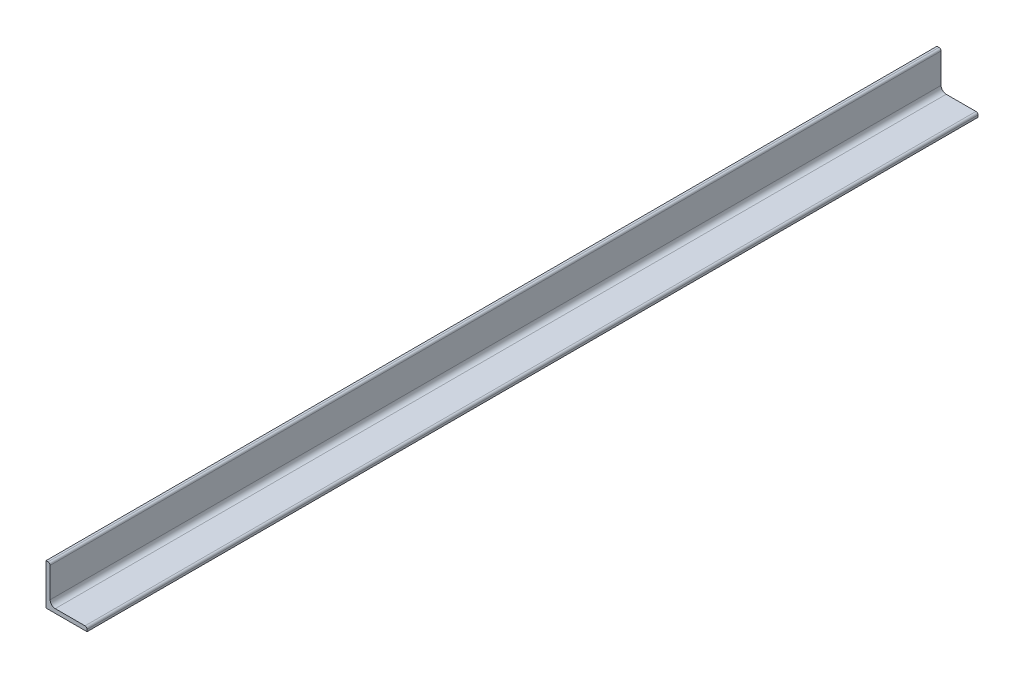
ISO-10303-21;
HEADER;
FILE_DESCRIPTION(('STEP AP214'),'2;1');
FILE_NAME('part.step','',(''),(''),'','','');
FILE_SCHEMA(('AUTOMOTIVE_DESIGN { 1 0 10303 214 1 1 1 1 }'));
ENDSEC;
DATA;
#1=APPLICATION_CONTEXT('core data for automotive mechanical design processes');
#2=APPLICATION_PROTOCOL_DEFINITION('international standard','automotive_design',2000,#1);
#3=PRODUCT_CONTEXT('',#1,'mechanical');
#4=PRODUCT('Part','Part','',(#3));
#5=PRODUCT_RELATED_PRODUCT_CATEGORY('part','',(#4));
#6=PRODUCT_DEFINITION_FORMATION('','',#4);
#7=PRODUCT_DEFINITION_CONTEXT('part definition',#1,'design');
#8=PRODUCT_DEFINITION('design','',#6,#7);
#9=PRODUCT_DEFINITION_SHAPE('','',#8);
#10=(LENGTH_UNIT() NAMED_UNIT(*) SI_UNIT(.MILLI.,.METRE.));
#11=(NAMED_UNIT(*) PLANE_ANGLE_UNIT() SI_UNIT($,.RADIAN.));
#12=(NAMED_UNIT(*) SI_UNIT($,.STERADIAN.) SOLID_ANGLE_UNIT());
#13=UNCERTAINTY_MEASURE_WITH_UNIT(LENGTH_MEASURE(1.E-05),#10,'distance_accuracy_value','');
#14=(GEOMETRIC_REPRESENTATION_CONTEXT(3) GLOBAL_UNCERTAINTY_ASSIGNED_CONTEXT((#13)) GLOBAL_UNIT_ASSIGNED_CONTEXT((#10,
#11,#12)) REPRESENTATION_CONTEXT('',''));
#15=CARTESIAN_POINT('',(0.,0.,0.));
#16=DIRECTION('',(0.,0.,1.));
#17=DIRECTION('',(1.,0.,0.));
#18=AXIS2_PLACEMENT_3D('',#15,#16,#17);
#19=CARTESIAN_POINT('',(1.99999999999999,40.,868.));
#20=DIRECTION('',(0.,-1.,0.));
#21=DIRECTION('',(0.,0.,-1.));
#22=AXIS2_PLACEMENT_3D('',#19,#20,#21);
#23=PLANE('',#22);
#24=DIRECTION('',(-1.,0.,0.));
#25=VECTOR('',#24,1.);
#26=CARTESIAN_POINT('',(1.99999999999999,40.,0.));
#27=LINE('',#26,#25);
#28=CARTESIAN_POINT('',(1.99999999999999,40.,0.));
#29=VERTEX_POINT('',#28);
#30=CARTESIAN_POINT('',(0.,40.,0.));
#31=VERTEX_POINT('',#30);
#32=EDGE_CURVE('E141',#29,#31,#27,.T.);
#33=ORIENTED_EDGE('',*,*,#32,.T.);
#34=DIRECTION('',(0.,0.,-1.));
#35=VECTOR('',#34,1.);
#36=CARTESIAN_POINT('',(0.,40.,868.));
#37=LINE('',#36,#35);
#38=CARTESIAN_POINT('',(0.,40.,868.));
#39=VERTEX_POINT('',#38);
#40=EDGE_CURVE('E11',#39,#31,#37,.T.);
#41=ORIENTED_EDGE('',*,*,#40,.F.);
#42=DIRECTION('',(-1.,0.,0.));
#43=VECTOR('',#42,1.);
#44=CARTESIAN_POINT('',(1.99999999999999,40.,868.));
#45=LINE('',#44,#43);
#46=CARTESIAN_POINT('',(1.99999999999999,40.,868.));
#47=VERTEX_POINT('',#46);
#48=EDGE_CURVE('E157',#47,#39,#45,.T.);
#49=ORIENTED_EDGE('',*,*,#48,.F.);
#50=DIRECTION('',(0.,0.,-1.));
#51=VECTOR('',#50,1.);
#52=CARTESIAN_POINT('',(1.99999999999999,40.,868.));
#53=LINE('',#52,#51);
#54=EDGE_CURVE('E137',#47,#29,#53,.T.);
#55=ORIENTED_EDGE('',*,*,#54,.T.);
#56=EDGE_LOOP('',(#33,#41,#49,#55));
#57=FACE_BOUND('',#56,.T.);
#58=ADVANCED_FACE('F39',(#57),#23,.F.);
#59=CARTESIAN_POINT('',(0.,40.,868.));
#60=DIRECTION('',(1.,0.,0.));
#61=DIRECTION('',(0.,1.,0.));
#62=AXIS2_PLACEMENT_3D('',#59,#60,#61);
#63=PLANE('',#62);
#64=DIRECTION('',(0.,-1.,0.));
#65=VECTOR('',#64,1.);
#66=CARTESIAN_POINT('',(0.,40.,0.));
#67=LINE('',#66,#65);
#68=CARTESIAN_POINT('',(0.,0.,0.));
#69=VERTEX_POINT('',#68);
#70=EDGE_CURVE('E144',#31,#69,#67,.T.);
#71=ORIENTED_EDGE('',*,*,#70,.T.);
#72=DIRECTION('',(0.,0.,-1.));
#73=VECTOR('',#72,1.);
#74=CARTESIAN_POINT('',(0.,0.,868.));
#75=LINE('',#74,#73);
#76=CARTESIAN_POINT('',(0.,0.,868.));
#77=VERTEX_POINT('',#76);
#78=EDGE_CURVE('E47',#77,#69,#75,.T.);
#79=ORIENTED_EDGE('',*,*,#78,.F.);
#80=DIRECTION('',(0.,-1.,0.));
#81=VECTOR('',#80,1.);
#82=CARTESIAN_POINT('',(0.,40.,868.));
#83=LINE('',#82,#81);
#84=EDGE_CURVE('E101',#39,#77,#83,.T.);
#85=ORIENTED_EDGE('',*,*,#84,.F.);
#86=ORIENTED_EDGE('',*,*,#40,.T.);
#87=EDGE_LOOP('',(#71,#79,#85,#86));
#88=FACE_BOUND('',#87,.T.);
#89=ADVANCED_FACE('F200',(#88),#63,.F.);
#90=CARTESIAN_POINT('',(0.,0.,868.));
#91=DIRECTION('',(0.,1.,0.));
#92=DIRECTION('',(0.,0.,1.));
#93=AXIS2_PLACEMENT_3D('',#90,#91,#92);
#94=PLANE('',#93);
#95=DIRECTION('',(1.,0.,0.));
#96=VECTOR('',#95,1.);
#97=CARTESIAN_POINT('',(0.,0.,0.));
#98=LINE('',#97,#96);
#99=CARTESIAN_POINT('',(40.,0.,0.));
#100=VERTEX_POINT('',#99);
#101=EDGE_CURVE('E146',#69,#100,#98,.T.);
#102=ORIENTED_EDGE('',*,*,#101,.T.);
#103=DIRECTION('',(0.,0.,-1.));
#104=VECTOR('',#103,1.);
#105=CARTESIAN_POINT('',(40.,0.,868.));
#106=LINE('',#105,#104);
#107=CARTESIAN_POINT('',(40.,0.,868.));
#108=VERTEX_POINT('',#107);
#109=EDGE_CURVE('E167',#108,#100,#106,.T.);
#110=ORIENTED_EDGE('',*,*,#109,.F.);
#111=DIRECTION('',(1.,0.,0.));
#112=VECTOR('',#111,1.);
#113=CARTESIAN_POINT('',(0.,0.,868.));
#114=LINE('',#113,#112);
#115=EDGE_CURVE('E175',#77,#108,#114,.T.);
#116=ORIENTED_EDGE('',*,*,#115,.F.);
#117=ORIENTED_EDGE('',*,*,#78,.T.);
#118=EDGE_LOOP('',(#102,#110,#116,#117));
#119=FACE_BOUND('',#118,.T.);
#120=ADVANCED_FACE('F173',(#119),#94,.F.);
#121=CARTESIAN_POINT('',(40.,0.,868.));
#122=DIRECTION('',(-1.,0.,0.));
#123=DIRECTION('',(0.,0.,1.));
#124=AXIS2_PLACEMENT_3D('',#121,#122,#123);
#125=PLANE('',#124);
#126=DIRECTION('',(0.,1.,0.));
#127=VECTOR('',#126,1.);
#128=CARTESIAN_POINT('',(40.,0.,0.));
#129=LINE('',#128,#127);
#130=CARTESIAN_POINT('',(40.,1.99999999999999,0.));
#131=VERTEX_POINT('',#130);
#132=EDGE_CURVE('E148',#100,#131,#129,.T.);
#133=ORIENTED_EDGE('',*,*,#132,.T.);
#134=DIRECTION('',(0.,0.,-1.));
#135=VECTOR('',#134,1.);
#136=CARTESIAN_POINT('',(40.,1.99999999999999,868.));
#137=LINE('',#136,#135);
#138=CARTESIAN_POINT('',(40.,1.99999999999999,868.));
#139=VERTEX_POINT('',#138);
#140=EDGE_CURVE('E164',#139,#131,#137,.T.);
#141=ORIENTED_EDGE('',*,*,#140,.F.);
#142=DIRECTION('',(0.,1.,0.));
#143=VECTOR('',#142,1.);
#144=CARTESIAN_POINT('',(40.,0.,868.));
#145=LINE('',#144,#143);
#146=EDGE_CURVE('E191',#108,#139,#145,.T.);
#147=ORIENTED_EDGE('',*,*,#146,.F.);
#148=ORIENTED_EDGE('',*,*,#109,.T.);
#149=EDGE_LOOP('',(#133,#141,#147,#148));
#150=FACE_BOUND('',#149,.T.);
#151=ADVANCED_FACE('F184',(#150),#125,.F.);
#152=CARTESIAN_POINT('',(38.,2.,868.));
#153=DIRECTION('',(0.,0.,-1.));
#154=DIRECTION('',(-1.,0.,0.));
#155=AXIS2_PLACEMENT_3D('',#152,#153,#154);
#156=CYLINDRICAL_SURFACE('',#155,2.);
#157=CARTESIAN_POINT('',(38.,2.,0.));
#158=DIRECTION('',(0.,0.,1.));
#159=DIRECTION('',(1.,0.,0.));
#160=AXIS2_PLACEMENT_3D('',#157,#158,#159);
#161=CIRCLE('',#160,2.);
#162=CARTESIAN_POINT('',(38.,4.,0.));
#163=VERTEX_POINT('',#162);
#164=EDGE_CURVE('E150',#131,#163,#161,.T.);
#165=ORIENTED_EDGE('',*,*,#164,.T.);
#166=DIRECTION('',(0.,0.,-1.));
#167=VECTOR('',#166,1.);
#168=CARTESIAN_POINT('',(38.,4.,868.));
#169=LINE('',#168,#167);
#170=CARTESIAN_POINT('',(38.,4.,868.));
#171=VERTEX_POINT('',#170);
#172=EDGE_CURVE('E161',#171,#163,#169,.T.);
#173=ORIENTED_EDGE('',*,*,#172,.F.);
#174=CARTESIAN_POINT('',(38.,2.,868.));
#175=DIRECTION('',(0.,0.,1.));
#176=DIRECTION('',(1.,0.,0.));
#177=AXIS2_PLACEMENT_3D('',#174,#175,#176);
#178=CIRCLE('',#177,2.);
#179=EDGE_CURVE('E190',#139,#171,#178,.T.);
#180=ORIENTED_EDGE('',*,*,#179,.F.);
#181=ORIENTED_EDGE('',*,*,#140,.T.);
#182=EDGE_LOOP('',(#165,#173,#180,#181));
#183=FACE_BOUND('',#182,.T.);
#184=ADVANCED_FACE('F188',(#183),#156,.T.);
#185=CARTESIAN_POINT('',(38.,4.,868.));
#186=DIRECTION('',(0.,-1.,0.));
#187=DIRECTION('',(1.,0.,0.));
#188=AXIS2_PLACEMENT_3D('',#185,#186,#187);
#189=PLANE('',#188);
#190=DIRECTION('',(-1.,0.,0.));
#191=VECTOR('',#190,1.);
#192=CARTESIAN_POINT('',(38.,4.,0.));
#193=LINE('',#192,#191);
#194=CARTESIAN_POINT('',(9.00000000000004,4.,0.));
#195=VERTEX_POINT('',#194);
#196=EDGE_CURVE('E152',#163,#195,#193,.T.);
#197=ORIENTED_EDGE('',*,*,#196,.T.);
#198=DIRECTION('',(0.,0.,-1.));
#199=VECTOR('',#198,1.);
#200=CARTESIAN_POINT('',(9.00000000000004,4.,868.));
#201=LINE('',#200,#199);
#202=CARTESIAN_POINT('',(9.00000000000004,4.,868.));
#203=VERTEX_POINT('',#202);
#204=EDGE_CURVE('E132',#203,#195,#201,.T.);
#205=ORIENTED_EDGE('',*,*,#204,.F.);
#206=DIRECTION('',(-1.,0.,0.));
#207=VECTOR('',#206,1.);
#208=CARTESIAN_POINT('',(38.,4.,868.));
#209=LINE('',#208,#207);
#210=EDGE_CURVE('E123',#171,#203,#209,.T.);
#211=ORIENTED_EDGE('',*,*,#210,.F.);
#212=ORIENTED_EDGE('',*,*,#172,.T.);
#213=EDGE_LOOP('',(#197,#205,#211,#212));
#214=FACE_BOUND('',#213,.T.);
#215=ADVANCED_FACE('F212',(#214),#189,.F.);
#216=CARTESIAN_POINT('',(9.,9.,868.));
#217=DIRECTION('',(0.,0.,-1.));
#218=DIRECTION('',(-1.,0.,0.));
#219=AXIS2_PLACEMENT_3D('',#216,#217,#218);
#220=CYLINDRICAL_SURFACE('',#219,5.);
#221=CARTESIAN_POINT('',(9.,9.,0.));
#222=DIRECTION('',(0.,0.,-1.));
#223=DIRECTION('',(-1.,0.,0.));
#224=AXIS2_PLACEMENT_3D('',#221,#222,#223);
#225=CIRCLE('',#224,5.);
#226=CARTESIAN_POINT('',(4.,9.00000000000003,0.));
#227=VERTEX_POINT('',#226);
#228=EDGE_CURVE('E131',#195,#227,#225,.T.);
#229=ORIENTED_EDGE('',*,*,#228,.T.);
#230=DIRECTION('',(0.,0.,-1.));
#231=VECTOR('',#230,1.);
#232=CARTESIAN_POINT('',(4.,9.00000000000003,868.));
#233=LINE('',#232,#231);
#234=CARTESIAN_POINT('',(4.,9.00000000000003,868.));
#235=VERTEX_POINT('',#234);
#236=EDGE_CURVE('E128',#235,#227,#233,.T.);
#237=ORIENTED_EDGE('',*,*,#236,.F.);
#238=CARTESIAN_POINT('',(9.,9.,868.));
#239=DIRECTION('',(0.,0.,-1.));
#240=DIRECTION('',(-1.,0.,0.));
#241=AXIS2_PLACEMENT_3D('',#238,#239,#240);
#242=CIRCLE('',#241,5.);
#243=EDGE_CURVE('E117',#203,#235,#242,.T.);
#244=ORIENTED_EDGE('',*,*,#243,.F.);
#245=ORIENTED_EDGE('',*,*,#204,.T.);
#246=EDGE_LOOP('',(#229,#237,#244,#245));
#247=FACE_BOUND('',#246,.T.);
#248=ADVANCED_FACE('F129',(#247),#220,.F.);
#249=CARTESIAN_POINT('',(4.,9.00000000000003,868.));
#250=DIRECTION('',(-1.,0.,0.));
#251=DIRECTION('',(0.,-1.,0.));
#252=AXIS2_PLACEMENT_3D('',#249,#250,#251);
#253=PLANE('',#252);
#254=DIRECTION('',(0.,1.,0.));
#255=VECTOR('',#254,1.);
#256=CARTESIAN_POINT('',(4.,9.00000000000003,0.));
#257=LINE('',#256,#255);
#258=CARTESIAN_POINT('',(4.,38.,0.));
#259=VERTEX_POINT('',#258);
#260=EDGE_CURVE('E87',#227,#259,#257,.T.);
#261=ORIENTED_EDGE('',*,*,#260,.T.);
#262=DIRECTION('',(0.,0.,-1.));
#263=VECTOR('',#262,1.);
#264=CARTESIAN_POINT('',(4.,38.,868.));
#265=LINE('',#264,#263);
#266=CARTESIAN_POINT('',(4.,38.,868.));
#267=VERTEX_POINT('',#266);
#268=EDGE_CURVE('E133',#267,#259,#265,.T.);
#269=ORIENTED_EDGE('',*,*,#268,.F.);
#270=DIRECTION('',(0.,1.,0.));
#271=VECTOR('',#270,1.);
#272=CARTESIAN_POINT('',(4.,9.00000000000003,868.));
#273=LINE('',#272,#271);
#274=EDGE_CURVE('E121',#235,#267,#273,.T.);
#275=ORIENTED_EDGE('',*,*,#274,.F.);
#276=ORIENTED_EDGE('',*,*,#236,.T.);
#277=EDGE_LOOP('',(#261,#269,#275,#276));
#278=FACE_BOUND('',#277,.T.);
#279=ADVANCED_FACE('F135',(#278),#253,.F.);
#280=CARTESIAN_POINT('',(2.,38.,868.));
#281=DIRECTION('',(0.,0.,-1.));
#282=DIRECTION('',(-1.,0.,0.));
#283=AXIS2_PLACEMENT_3D('',#280,#281,#282);
#284=CYLINDRICAL_SURFACE('',#283,2.);
#285=CARTESIAN_POINT('',(2.,38.,0.));
#286=DIRECTION('',(0.,0.,1.));
#287=DIRECTION('',(1.,0.,0.));
#288=AXIS2_PLACEMENT_3D('',#285,#286,#287);
#289=CIRCLE('',#288,2.);
#290=EDGE_CURVE('E93',#259,#29,#289,.T.);
#291=ORIENTED_EDGE('',*,*,#290,.T.);
#292=ORIENTED_EDGE('',*,*,#54,.F.);
#293=CARTESIAN_POINT('',(2.,38.,868.));
#294=DIRECTION('',(0.,0.,1.));
#295=DIRECTION('',(1.,0.,0.));
#296=AXIS2_PLACEMENT_3D('',#293,#294,#295);
#297=CIRCLE('',#296,2.);
#298=EDGE_CURVE('E55',#267,#47,#297,.T.);
#299=ORIENTED_EDGE('',*,*,#298,.F.);
#300=ORIENTED_EDGE('',*,*,#268,.T.);
#301=EDGE_LOOP('',(#291,#292,#299,#300));
#302=FACE_BOUND('',#301,.T.);
#303=ADVANCED_FACE('F220',(#302),#284,.T.);
#304=CARTESIAN_POINT('',(38.,2.,868.));
#305=DIRECTION('',(0.,0.,1.));
#306=DIRECTION('',(1.,0.,0.));
#307=AXIS2_PLACEMENT_3D('',#304,#305,#306);
#308=PLANE('',#307);
#309=ORIENTED_EDGE('',*,*,#48,.T.);
#310=ORIENTED_EDGE('',*,*,#84,.T.);
#311=ORIENTED_EDGE('',*,*,#115,.T.);
#312=ORIENTED_EDGE('',*,*,#146,.T.);
#313=ORIENTED_EDGE('',*,*,#179,.T.);
#314=ORIENTED_EDGE('',*,*,#210,.T.);
#315=ORIENTED_EDGE('',*,*,#243,.T.);
#316=ORIENTED_EDGE('',*,*,#274,.T.);
#317=ORIENTED_EDGE('',*,*,#298,.T.);
#318=EDGE_LOOP('',(#309,#310,#311,#312,#313,#314,#315,#316,#317));
#319=FACE_BOUND('',#318,.T.);
#320=ADVANCED_FACE('F119',(#319),#308,.T.);
#321=CARTESIAN_POINT('',(38.,2.,0.));
#322=DIRECTION('',(0.,0.,1.));
#323=DIRECTION('',(1.,0.,0.));
#324=AXIS2_PLACEMENT_3D('',#321,#322,#323);
#325=PLANE('',#324);
#326=ORIENTED_EDGE('',*,*,#32,.F.);
#327=ORIENTED_EDGE('',*,*,#290,.F.);
#328=ORIENTED_EDGE('',*,*,#260,.F.);
#329=ORIENTED_EDGE('',*,*,#228,.F.);
#330=ORIENTED_EDGE('',*,*,#196,.F.);
#331=ORIENTED_EDGE('',*,*,#164,.F.);
#332=ORIENTED_EDGE('',*,*,#132,.F.);
#333=ORIENTED_EDGE('',*,*,#101,.F.);
#334=ORIENTED_EDGE('',*,*,#70,.F.);
#335=EDGE_LOOP('',(#326,#327,#328,#329,#330,#331,#332,#333,#334));
#336=FACE_BOUND('',#335,.T.);
#337=ADVANCED_FACE('F179',(#336),#325,.F.);
#338=CLOSED_SHELL('',(#58,#89,#120,#151,#184,#215,#248,#279,#303,#320,#337));
#339=MANIFOLD_SOLID_BREP('B2',#338);
#340=ADVANCED_BREP_SHAPE_REPRESENTATION('',(#18,#339),#14);
#341=SHAPE_DEFINITION_REPRESENTATION(#9,#340);
ENDSEC;
END-ISO-10303-21;
